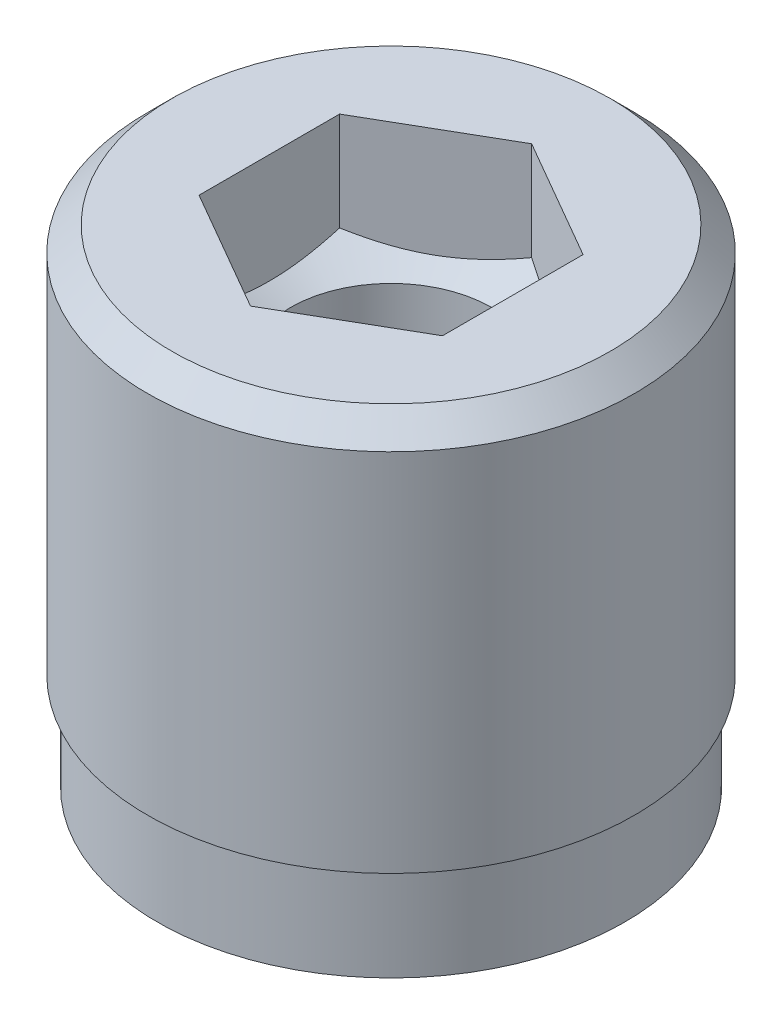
ISO-10303-21;
HEADER;
FILE_DESCRIPTION(('STEP AP214'),'2;1');
FILE_NAME('part.step','',(''),(''),'','','');
FILE_SCHEMA(('AUTOMOTIVE_DESIGN { 1 0 10303 214 1 1 1 1 }'));
ENDSEC;
DATA;
#1=APPLICATION_CONTEXT('core data for automotive mechanical design processes');
#2=APPLICATION_PROTOCOL_DEFINITION('international standard','automotive_design',2000,#1);
#3=PRODUCT_CONTEXT('',#1,'mechanical');
#4=PRODUCT('Part','Part','',(#3));
#5=PRODUCT_RELATED_PRODUCT_CATEGORY('part','',(#4));
#6=PRODUCT_DEFINITION_FORMATION('','',#4);
#7=PRODUCT_DEFINITION_CONTEXT('part definition',#1,'design');
#8=PRODUCT_DEFINITION('design','',#6,#7);
#9=PRODUCT_DEFINITION_SHAPE('','',#8);
#10=(LENGTH_UNIT() NAMED_UNIT(*) SI_UNIT(.MILLI.,.METRE.));
#11=(NAMED_UNIT(*) PLANE_ANGLE_UNIT() SI_UNIT($,.RADIAN.));
#12=(NAMED_UNIT(*) SI_UNIT($,.STERADIAN.) SOLID_ANGLE_UNIT());
#13=UNCERTAINTY_MEASURE_WITH_UNIT(LENGTH_MEASURE(1.E-05),#10,'distance_accuracy_value','');
#14=(GEOMETRIC_REPRESENTATION_CONTEXT(3) GLOBAL_UNCERTAINTY_ASSIGNED_CONTEXT((#13)) GLOBAL_UNIT_ASSIGNED_CONTEXT((#10,
#11,#12)) REPRESENTATION_CONTEXT('',''));
#15=CARTESIAN_POINT('',(0.,0.,0.));
#16=DIRECTION('',(0.,0.,1.));
#17=DIRECTION('',(1.,0.,0.));
#18=AXIS2_PLACEMENT_3D('',#15,#16,#17);
#19=CARTESIAN_POINT('',(0.,0.,0.));
#20=DIRECTION('',(0.,-1.,0.));
#21=DIRECTION('',(0.,0.,-1.));
#22=AXIS2_PLACEMENT_3D('',#19,#20,#21);
#23=CYLINDRICAL_SURFACE('',#22,2.065);
#24=CARTESIAN_POINT('',(0.,-3.75,0.));
#25=DIRECTION('',(0.,-1.,0.));
#26=DIRECTION('',(0.,0.,-1.));
#27=AXIS2_PLACEMENT_3D('',#24,#25,#26);
#28=CIRCLE('',#27,2.065);
#29=CARTESIAN_POINT('',(0.,-3.75,-2.065));
#30=VERTEX_POINT('',#29);
#31=EDGE_CURVE('E134',#30,#30,#28,.T.);
#32=ORIENTED_EDGE('',*,*,#31,.T.);
#33=EDGE_LOOP('',(#32));
#34=FACE_BOUND('',#33,.T.);
#35=CARTESIAN_POINT('',(0.,3.75,0.));
#36=DIRECTION('',(0.,-1.,0.));
#37=DIRECTION('',(0.,0.,-1.));
#38=AXIS2_PLACEMENT_3D('',#35,#36,#37);
#39=CIRCLE('',#38,2.065);
#40=CARTESIAN_POINT('',(0.,3.75,-2.065));
#41=VERTEX_POINT('',#40);
#42=EDGE_CURVE('E11',#41,#41,#39,.T.);
#43=ORIENTED_EDGE('',*,*,#42,.F.);
#44=EDGE_LOOP('',(#43));
#45=FACE_BOUND('',#44,.T.);
#46=ADVANCED_FACE('F33',(#34,#45),#23,.F.);
#47=CARTESIAN_POINT('',(0.,3.86547005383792,0.));
#48=DIRECTION('',(0.,1.,0.));
#49=DIRECTION('',(0.,0.,1.));
#50=AXIS2_PLACEMENT_3D('',#47,#48,#49);
#51=CONICAL_SURFACE('',#50,2.265,1.0471975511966);
#52=ORIENTED_EDGE('',*,*,#42,.T.);
#53=EDGE_LOOP('',(#52));
#54=FACE_BOUND('',#53,.T.);
#55=CARTESIAN_POINT('',(-0.000200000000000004,4.22450503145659,-2.88686681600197));
#56=CARTESIAN_POINT('',(0.109663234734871,4.18786898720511,-2.82343724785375));
#57=CARTESIAN_POINT('',(0.220474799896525,4.15454958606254,-2.75946016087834));
#58=CARTESIAN_POINT('',(0.444016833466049,4.09638965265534,-2.63039810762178));
#59=CARTESIAN_POINT('',(0.556751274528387,4.07156969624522,-2.5653108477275));
#60=CARTESIAN_POINT('',(0.780822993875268,4.03293301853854,-2.43594298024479));
#61=CARTESIAN_POINT('',(0.892125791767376,4.01885916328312,-2.37168227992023));
#62=CARTESIAN_POINT('',(1.11525522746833,4.00205651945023,-2.24285844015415));
#63=CARTESIAN_POINT('',(1.22708105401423,3.99931381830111,-2.17829576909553));
#64=CARTESIAN_POINT('',(1.43604197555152,4.00501312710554,-2.05765212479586));
#65=CARTESIAN_POINT('',(1.53320831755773,4.01205576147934,-2.0015531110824));
#66=CARTESIAN_POINT('',(1.726907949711,4.03437878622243,-1.88972057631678));
#67=CARTESIAN_POINT('',(1.82344056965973,4.04966680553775,-1.8339874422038));
#68=CARTESIAN_POINT('',(2.01753972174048,4.0878864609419,-1.7219242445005));
#69=CARTESIAN_POINT('',(2.11508168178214,4.110980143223,-1.66560836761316));
#70=CARTESIAN_POINT('',(2.30871060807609,4.1633940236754,-1.55381665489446));
#71=CARTESIAN_POINT('',(2.40480005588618,4.19270190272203,-1.49833938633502));
#72=CARTESIAN_POINT('',(2.5002,4.22450503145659,-1.44326020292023));
#73=B_SPLINE_CURVE_WITH_KNOTS('',3,(#55,#56,#57,#58,#59,#60,#61,#62,#63,#64,#65,#66,#67,#68,#69,
#70,#71,#72),.UNSPECIFIED.,.F.,.F.,(4,2,2,2,2,2,2,2,4),(0.,0.396285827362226,0.793524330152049,
1.18093086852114,1.56786160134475,1.90479741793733,2.24204551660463,2.58677531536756,
2.93082800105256),.UNSPECIFIED.);
#74=CARTESIAN_POINT('',(0.,4.22443836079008,-2.88675134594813));
#75=VERTEX_POINT('',#74);
#76=CARTESIAN_POINT('',(2.5,4.22443836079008,-1.44337567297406));
#77=VERTEX_POINT('',#76);
#78=EDGE_CURVE('E70',#75,#77,#73,.T.);
#79=ORIENTED_EDGE('',*,*,#78,.F.);
#80=CARTESIAN_POINT('',(-2.5002,4.22450503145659,-1.44326020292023));
#81=CARTESIAN_POINT('',(-2.39033676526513,4.18786898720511,-1.50668977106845));
#82=CARTESIAN_POINT('',(-2.27952520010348,4.15454958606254,-1.57066685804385));
#83=CARTESIAN_POINT('',(-2.05598316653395,4.09638965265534,-1.69972891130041));
#84=CARTESIAN_POINT('',(-1.94324872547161,4.07156969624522,-1.7648161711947));
#85=CARTESIAN_POINT('',(-1.71917700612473,4.03293301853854,-1.8941840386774));
#86=CARTESIAN_POINT('',(-1.60787420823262,4.01885916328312,-1.95844473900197));
#87=CARTESIAN_POINT('',(-1.38474477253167,4.00205651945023,-2.08726857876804));
#88=CARTESIAN_POINT('',(-1.27291894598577,3.99931381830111,-2.15183124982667));
#89=CARTESIAN_POINT('',(-1.06395802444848,4.00501312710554,-2.27247489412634));
#90=CARTESIAN_POINT('',(-0.96679168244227,4.01205576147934,-2.32857390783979));
#91=CARTESIAN_POINT('',(-0.773092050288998,4.03437878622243,-2.44040644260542));
#92=CARTESIAN_POINT('',(-0.676559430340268,4.04966680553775,-2.4961395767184));
#93=CARTESIAN_POINT('',(-0.482460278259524,4.0878864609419,-2.60820277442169));
#94=CARTESIAN_POINT('',(-0.38491831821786,4.110980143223,-2.66451865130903));
#95=CARTESIAN_POINT('',(-0.191289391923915,4.1633940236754,-2.77631036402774));
#96=CARTESIAN_POINT('',(-0.0951999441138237,4.19270190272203,-2.83178763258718));
#97=CARTESIAN_POINT('',(0.000200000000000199,4.22450503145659,-2.88686681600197));
#98=B_SPLINE_CURVE_WITH_KNOTS('',3,(#80,#81,#82,#83,#84,#85,#86,#87,#88,#89,#90,#91,#92,#93,#94,
#95,#96,#97),.UNSPECIFIED.,.F.,.F.,(4,2,2,2,2,2,2,2,4),(0.,0.396285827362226,0.79352433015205,
1.18093086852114,1.56786160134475,1.90479741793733,2.24204551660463,2.58677531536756,
2.93082800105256),.UNSPECIFIED.);
#99=CARTESIAN_POINT('',(-2.5,4.22443836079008,-1.44337567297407));
#100=VERTEX_POINT('',#99);
#101=EDGE_CURVE('E55',#100,#75,#98,.T.);
#102=ORIENTED_EDGE('',*,*,#101,.F.);
#103=CARTESIAN_POINT('',(-2.5,5.17474965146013,-3.7809682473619));
#104=CARTESIAN_POINT('',(-2.5,5.12250546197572,-3.67245506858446));
#105=CARTESIAN_POINT('',(-2.5,5.07079126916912,-3.56368198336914));
#106=CARTESIAN_POINT('',(-2.5,4.96872343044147,-3.34547718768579));
#107=CARTESIAN_POINT('',(-2.5,4.918370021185,-3.23604536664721));
#108=CARTESIAN_POINT('',(-2.5,4.8190503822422,-3.01577368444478));
#109=CARTESIAN_POINT('',(-2.5,4.77009409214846,-2.90492932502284));
#110=CARTESIAN_POINT('',(-2.5,4.67432110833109,-2.68232344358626));
#111=CARTESIAN_POINT('',(-2.5,4.62750430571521,-2.5705619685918));
#112=CARTESIAN_POINT('',(-2.5,4.53535356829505,-2.34291627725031));
#113=CARTESIAN_POINT('',(-2.5,4.49009339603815,-2.22700202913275));
#114=CARTESIAN_POINT('',(-2.5,4.40323711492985,-1.99378304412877));
#115=CARTESIAN_POINT('',(-2.5,4.36164142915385,-1.87647814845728));
#116=CARTESIAN_POINT('',(-2.5,4.28327574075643,-1.6405430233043));
#117=CARTESIAN_POINT('',(-2.5,4.24649511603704,-1.52191635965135));
#118=CARTESIAN_POINT('',(-2.5,4.17900136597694,-1.28296660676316));
#119=CARTESIAN_POINT('',(-2.5,4.14828622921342,-1.16264409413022));
#120=CARTESIAN_POINT('',(-2.5,4.09459350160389,-0.920790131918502));
#121=CARTESIAN_POINT('',(-2.5,4.07158349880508,-0.799266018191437));
#122=CARTESIAN_POINT('',(-2.5,4.0346975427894,-0.554814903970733));
#123=CARTESIAN_POINT('',(-2.5,4.02082079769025,-0.431888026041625));
#124=CARTESIAN_POINT('',(-2.5,4.00348927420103,-0.186798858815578));
#125=CARTESIAN_POINT('',(-2.5,3.99990876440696,-0.064645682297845));
#126=CARTESIAN_POINT('',(-2.5,4.00314793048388,0.179533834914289));
#127=CARTESIAN_POINT('',(-2.5,4.00996839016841,0.301560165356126));
#128=CARTESIAN_POINT('',(-2.5,4.03019153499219,0.51157116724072));
#129=CARTESIAN_POINT('',(-2.5,4.04129956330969,0.599788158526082));
#130=CARTESIAN_POINT('',(-2.5,4.0682067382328,0.775508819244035));
#131=CARTESIAN_POINT('',(-2.5,4.08400659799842,0.863012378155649));
#132=CARTESIAN_POINT('',(-2.5,4.13760551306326,1.12436306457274));
#133=CARTESIAN_POINT('',(-2.5,4.18159320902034,1.29695150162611));
#134=CARTESIAN_POINT('',(-2.5,4.25707008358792,1.55516150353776));
#135=CARTESIAN_POINT('',(-2.5,4.28418817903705,1.64213551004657));
#136=CARTESIAN_POINT('',(-2.5,4.34102860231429,1.81523661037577));
#137=CARTESIAN_POINT('',(-2.5,4.37075095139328,1.90136369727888));
#138=CARTESIAN_POINT('',(-2.5,4.43234048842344,2.07280689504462));
#139=CARTESIAN_POINT('',(-2.5,4.46420692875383,2.15812327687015));
#140=CARTESIAN_POINT('',(-2.5,4.52973127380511,2.32805984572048));
#141=CARTESIAN_POINT('',(-2.5,4.56338911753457,2.41268005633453));
#142=CARTESIAN_POINT('',(-2.5,4.67264979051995,2.68049828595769));
#143=CARTESIAN_POINT('',(-2.5,4.75102087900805,2.86256625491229));
#144=CARTESIAN_POINT('',(-2.5,4.91253856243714,3.22458004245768));
#145=CARTESIAN_POINT('',(-2.5,4.99568595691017,3.40452549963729));
#146=CARTESIAN_POINT('',(-2.5,5.16538487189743,3.76290370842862));
#147=CARTESIAN_POINT('',(-2.5,5.25193799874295,3.94133569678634));
#148=CARTESIAN_POINT('',(-2.5,5.42748179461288,4.29699920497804));
#149=CARTESIAN_POINT('',(-2.5,5.51647254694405,4.47423068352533));
#150=CARTESIAN_POINT('',(-2.5,5.69643113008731,4.8281027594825));
#151=CARTESIAN_POINT('',(-2.5,5.78740234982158,5.00474162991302));
#152=CARTESIAN_POINT('',(-2.5,5.97072878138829,5.35730043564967));
#153=CARTESIAN_POINT('',(-2.5,6.06308400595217,5.5332203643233));
#154=CARTESIAN_POINT('',(-2.5,6.34168357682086,6.06003161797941));
#155=CARTESIAN_POINT('',(-2.5,6.52951705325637,6.41008197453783));
#156=CARTESIAN_POINT('',(-2.5,6.88280460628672,7.06247892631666));
#157=CARTESIAN_POINT('',(-2.5,7.047928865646,7.36500491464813));
#158=CARTESIAN_POINT('',(-2.5,7.37962766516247,7.96929540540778));
#159=CARTESIAN_POINT('',(-2.5,7.54620233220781,8.27105983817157));
#160=CARTESIAN_POINT('',(-2.5,7.87979869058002,8.87293648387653));
#161=CARTESIAN_POINT('',(-2.5,8.0468166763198,9.17305075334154));
#162=CARTESIAN_POINT('',(-2.5,8.38163185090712,9.77280547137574));
#163=CARTESIAN_POINT('',(-2.5,8.54942896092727,10.0724459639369));
#164=CARTESIAN_POINT('',(-2.5,8.71750442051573,10.3719295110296));
#165=B_SPLINE_CURVE_WITH_KNOTS('',3,(#103,#104,#105,#106,#107,#108,#109,#110,#111,#112,#113,
#114,#115,#116,#117,#118,#119,#120,#121,#122,#123,#124,#125,#126,#127,#128,#129,#130,#131,#132,
#133,#134,#135,#136,#137,#138,#139,#140,#141,#142,#143,#144,#145,#146,#147,#148,#149,#150,#151,
#152,#153,#154,#155,#156,#157,#158,#159,#160,#161,#162,#163,#164),.UNSPECIFIED.,.F.,.F.,(4,2,2,
2,2,2,2,2,2,2,2,2,2,2,2,2,2,2,2,2,2,2,2,2,2,2,2,2,2,2,4),(0.,0.361309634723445,
0.722681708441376,1.0861863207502,1.44967241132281,1.82293594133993,2.19624250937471,
2.56871115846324,2.9410560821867,3.3118144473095,3.68254066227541,4.04872016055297,
4.41492725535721,4.68153717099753,4.94818763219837,5.48178506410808,5.75507544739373,
6.02836806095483,6.30156586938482,6.57475438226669,7.16929370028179,7.76393283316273,
8.35885587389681,8.95379927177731,9.54985629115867,10.1459187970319,11.3376810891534,
12.3716464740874,13.4057032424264,14.4360768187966,15.4663483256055),.UNSPECIFIED.);
#166=CARTESIAN_POINT('',(-2.5,4.22443836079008,1.44337567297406));
#167=VERTEX_POINT('',#166);
#168=EDGE_CURVE('E78',#167,#100,#165,.F.);
#169=ORIENTED_EDGE('',*,*,#168,.F.);
#170=CARTESIAN_POINT('',(0.000200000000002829,4.22450503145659,2.88686681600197));
#171=CARTESIAN_POINT('',(-0.109663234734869,4.18786898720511,2.82343724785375));
#172=CARTESIAN_POINT('',(-0.220474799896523,4.15454958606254,2.75946016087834));
#173=CARTESIAN_POINT('',(-0.444016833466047,4.09638965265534,2.63039810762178));
#174=CARTESIAN_POINT('',(-0.556751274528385,4.07156969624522,2.5653108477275));
#175=CARTESIAN_POINT('',(-0.780822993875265,4.03293301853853,2.43594298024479));
#176=CARTESIAN_POINT('',(-0.892125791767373,4.01885916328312,2.37168227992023));
#177=CARTESIAN_POINT('',(-1.11525522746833,4.00205651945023,2.24285844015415));
#178=CARTESIAN_POINT('',(-1.22708105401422,3.99931381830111,2.17829576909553));
#179=CARTESIAN_POINT('',(-1.43604197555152,4.00501312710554,2.05765212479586));
#180=CARTESIAN_POINT('',(-1.53320831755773,4.01205576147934,2.0015531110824));
#181=CARTESIAN_POINT('',(-1.726907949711,4.03437878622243,1.88972057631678));
#182=CARTESIAN_POINT('',(-1.82344056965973,4.04966680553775,1.8339874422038));
#183=CARTESIAN_POINT('',(-2.01753972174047,4.0878864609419,1.7219242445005));
#184=CARTESIAN_POINT('',(-2.11508168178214,4.110980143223,1.66560836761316));
#185=CARTESIAN_POINT('',(-2.30871060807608,4.16339402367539,1.55381665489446));
#186=CARTESIAN_POINT('',(-2.40480005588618,4.19270190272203,1.49833938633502));
#187=CARTESIAN_POINT('',(-2.5002,4.22450503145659,1.44326020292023));
#188=B_SPLINE_CURVE_WITH_KNOTS('',3,(#170,#171,#172,#173,#174,#175,#176,#177,#178,#179,#180,
#181,#182,#183,#184,#185,#186,#187),.UNSPECIFIED.,.F.,.F.,(4,2,2,2,2,2,2,2,4),(0.,
0.396285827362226,0.79352433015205,1.18093086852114,1.56786160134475,1.90479741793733,
2.24204551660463,2.58677531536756,2.93082800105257),.UNSPECIFIED.);
#189=CARTESIAN_POINT('',(0.,4.22443836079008,2.88675134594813));
#190=VERTEX_POINT('',#189);
#191=EDGE_CURVE('E156',#190,#167,#188,.T.);
#192=ORIENTED_EDGE('',*,*,#191,.F.);
#193=CARTESIAN_POINT('',(2.5002,4.22450503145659,1.44326020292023));
#194=CARTESIAN_POINT('',(2.39033676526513,4.18786898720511,1.50668977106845));
#195=CARTESIAN_POINT('',(2.27952520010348,4.15454958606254,1.57066685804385));
#196=CARTESIAN_POINT('',(2.05598316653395,4.09638965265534,1.69972891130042));
#197=CARTESIAN_POINT('',(1.94324872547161,4.07156969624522,1.7648161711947));
#198=CARTESIAN_POINT('',(1.71917700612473,4.03293301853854,1.8941840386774));
#199=CARTESIAN_POINT('',(1.60787420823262,4.01885916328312,1.95844473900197));
#200=CARTESIAN_POINT('',(1.38474477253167,4.00205651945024,2.08726857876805));
#201=CARTESIAN_POINT('',(1.27291894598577,3.99931381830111,2.15183124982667));
#202=CARTESIAN_POINT('',(1.06395802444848,4.00501312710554,2.27247489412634));
#203=CARTESIAN_POINT('',(0.96679168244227,4.01205576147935,2.3285739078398));
#204=CARTESIAN_POINT('',(0.773092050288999,4.03437878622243,2.44040644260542));
#205=CARTESIAN_POINT('',(0.67655943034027,4.04966680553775,2.4961395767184));
#206=CARTESIAN_POINT('',(0.482460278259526,4.0878864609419,2.60820277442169));
#207=CARTESIAN_POINT('',(0.384918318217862,4.110980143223,2.66451865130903));
#208=CARTESIAN_POINT('',(0.191289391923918,4.16339402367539,2.77631036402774));
#209=CARTESIAN_POINT('',(0.0951999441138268,4.19270190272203,2.83178763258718));
#210=CARTESIAN_POINT('',(-0.000199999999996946,4.22450503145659,2.88686681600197));
#211=B_SPLINE_CURVE_WITH_KNOTS('',3,(#193,#194,#195,#196,#197,#198,#199,#200,#201,#202,#203,
#204,#205,#206,#207,#208,#209,#210),.UNSPECIFIED.,.F.,.F.,(4,2,2,2,2,2,2,2,4),(0.,
0.396285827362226,0.79352433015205,1.18093086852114,1.56786160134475,1.90479741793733,
2.24204551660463,2.58677531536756,2.93082800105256),.UNSPECIFIED.);
#212=CARTESIAN_POINT('',(2.5,4.22443836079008,1.44337567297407));
#213=VERTEX_POINT('',#212);
#214=EDGE_CURVE('E162',#213,#190,#211,.T.);
#215=ORIENTED_EDGE('',*,*,#214,.F.);
#216=CARTESIAN_POINT('',(2.5,5.17474965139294,-3.78096824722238));
#217=CARTESIAN_POINT('',(2.5,5.12250546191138,-3.67245506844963));
#218=CARTESIAN_POINT('',(2.5,5.07079126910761,-3.56368198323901));
#219=CARTESIAN_POINT('',(2.5,4.96872343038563,-3.34547718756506));
#220=CARTESIAN_POINT('',(2.5,4.91837002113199,-3.23604536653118));
#221=CARTESIAN_POINT('',(2.5,4.81905038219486,-3.01577368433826));
#222=CARTESIAN_POINT('',(2.5,4.77009409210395,-2.9049293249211));
#223=CARTESIAN_POINT('',(2.5,4.67432110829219,-2.68232344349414));
#224=CARTESIAN_POINT('',(2.5,4.6275043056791,-2.57056196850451));
#225=CARTESIAN_POINT('',(2.5,4.53535356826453,-2.34291627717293));
#226=CARTESIAN_POINT('',(2.5,4.49009339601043,-2.22700202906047));
#227=CARTESIAN_POINT('',(2.5,4.40323711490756,-1.99378304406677));
#228=CARTESIAN_POINT('',(2.5,4.36164142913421,-1.87647814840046));
#229=CARTESIAN_POINT('',(2.5,4.2832757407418,-1.64054302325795));
#230=CARTESIAN_POINT('',(2.5,4.24649511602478,-1.52191635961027));
#231=CARTESIAN_POINT('',(2.5,4.17900136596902,-1.2829666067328));
#232=CARTESIAN_POINT('',(2.5,4.14828622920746,-1.16264409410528));
#233=CARTESIAN_POINT('',(2.5,4.09459350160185,-0.920790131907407));
#234=CARTESIAN_POINT('',(2.5,4.07158349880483,-0.799266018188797));
#235=CARTESIAN_POINT('',(2.5,4.03469754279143,-0.554814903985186));
#236=CARTESIAN_POINT('',(2.5,4.02082079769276,-0.431888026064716));
#237=CARTESIAN_POINT('',(2.5,4.003489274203,-0.186798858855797));
#238=CARTESIAN_POINT('',(2.5,3.99990876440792,-0.0646456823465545));
#239=CARTESIAN_POINT('',(2.5,4.0031479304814,0.179533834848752));
#240=CARTESIAN_POINT('',(2.5,4.0099683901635,0.301560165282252));
#241=CARTESIAN_POINT('',(2.5,4.03019153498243,0.51157116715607));
#242=CARTESIAN_POINT('',(2.5,4.04129956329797,0.599788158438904));
#243=CARTESIAN_POINT('',(2.5,4.06820673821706,0.775508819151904));
#244=CARTESIAN_POINT('',(2.5,4.08400659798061,0.863012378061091));
#245=CARTESIAN_POINT('',(2.5,4.13760551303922,1.12436306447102));
#246=CARTESIAN_POINT('',(2.5,4.18159320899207,1.29695150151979));
#247=CARTESIAN_POINT('',(2.5,4.25707008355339,1.55516150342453));
#248=CARTESIAN_POINT('',(2.5,4.28418817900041,1.64213550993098));
#249=CARTESIAN_POINT('',(2.5,4.34102860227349,1.81523661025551));
#250=CARTESIAN_POINT('',(2.5,4.37075095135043,1.90136369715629));
#251=CARTESIAN_POINT('',(2.5,4.43234048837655,2.07280689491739));
#252=CARTESIAN_POINT('',(2.5,4.46420692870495,2.1581232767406));
#253=CARTESIAN_POINT('',(2.5,4.52973127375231,2.3280598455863));
#254=CARTESIAN_POINT('',(2.5,4.56338911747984,2.41268005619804));
#255=CARTESIAN_POINT('',(2.5,4.67264979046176,2.68049828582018));
#256=CARTESIAN_POINT('',(2.5,4.75102087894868,2.86256625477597));
#257=CARTESIAN_POINT('',(2.5,4.91253856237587,3.22458004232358));
#258=CARTESIAN_POINT('',(2.5,4.99568595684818,3.40452549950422));
#259=CARTESIAN_POINT('',(2.5,5.16538487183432,3.76290370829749));
#260=CARTESIAN_POINT('',(2.5,5.25193799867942,3.94133569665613));
#261=CARTESIAN_POINT('',(2.5,5.42748179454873,4.29699920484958));
#262=CARTESIAN_POINT('',(2.5,5.51647254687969,4.4742306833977));
#263=CARTESIAN_POINT('',(2.5,5.6964311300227,4.82810275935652));
#264=CARTESIAN_POINT('',(2.5,5.78740234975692,5.00474162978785));
#265=CARTESIAN_POINT('',(2.5,5.97072878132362,5.3573004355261));
#266=CARTESIAN_POINT('',(2.5,6.06308400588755,5.5332203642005));
#267=CARTESIAN_POINT('',(2.5,6.34168357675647,6.06003161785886));
#268=CARTESIAN_POINT('',(2.5,6.52951705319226,6.41008197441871));
#269=CARTESIAN_POINT('',(2.5,6.88280460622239,7.0624789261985));
#270=CARTESIAN_POINT('',(2.5,7.04792886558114,7.36500491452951));
#271=CARTESIAN_POINT('',(2.5,7.3796276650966,7.96929540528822));
#272=CARTESIAN_POINT('',(2.5,7.54620233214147,8.27105983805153));
#273=CARTESIAN_POINT('',(2.5,7.87979869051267,8.87293648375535));
#274=CARTESIAN_POINT('',(2.5,8.04681667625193,9.17305075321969));
#275=CARTESIAN_POINT('',(2.5,8.38163185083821,9.77280547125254));
#276=CARTESIAN_POINT('',(2.5,8.54942896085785,10.0724459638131));
#277=CARTESIAN_POINT('',(2.5,8.71750442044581,10.3719295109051));
#278=B_SPLINE_CURVE_WITH_KNOTS('',3,(#216,#217,#218,#219,#220,#221,#222,#223,#224,#225,#226,
#227,#228,#229,#230,#231,#232,#233,#234,#235,#236,#237,#238,#239,#240,#241,#242,#243,#244,#245,
#246,#247,#248,#249,#250,#251,#252,#253,#254,#255,#256,#257,#258,#259,#260,#261,#262,#263,#264,
#265,#266,#267,#268,#269,#270,#271,#272,#273,#274,#275,#276,#277),.UNSPECIFIED.,.F.,.F.,(4,2,2,
2,2,2,2,2,2,2,2,2,2,2,2,2,2,2,2,2,2,2,2,2,2,2,2,2,2,2,4),(0.,0.361309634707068,
0.722681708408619,1.08618632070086,1.44967241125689,1.82293594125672,2.1962425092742,
2.56871115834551,2.94105608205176,3.31181444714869,3.68254066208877,4.04872016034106,
4.41492725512,4.68153717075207,4.94818763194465,5.48178506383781,5.75507544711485,
6.02836806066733,6.30156586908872,6.574754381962,7.16929369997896,7.76393283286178,
8.3588558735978,8.95379927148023,9.54985629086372,10.1459187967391,11.3376810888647,
12.3716464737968,13.4057032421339,14.4360768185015,15.4663483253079),.UNSPECIFIED.);
#279=EDGE_CURVE('E168',#77,#213,#278,.T.);
#280=ORIENTED_EDGE('',*,*,#279,.F.);
#281=EDGE_LOOP('',(#79,#102,#169,#192,#215,#280));
#282=FACE_BOUND('',#281,.T.);
#283=ADVANCED_FACE('F139',(#54,#282),#51,.F.);
#284=CARTESIAN_POINT('',(2.265,6.25,0.));
#285=DIRECTION('',(0.,1.,0.));
#286=DIRECTION('',(0.,0.,1.));
#287=AXIS2_PLACEMENT_3D('',#284,#285,#286);
#288=PLANE('',#287);
#289=DIRECTION('',(-0.866025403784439,0.,-0.5));
#290=VECTOR('',#289,1.);
#291=CARTESIAN_POINT('',(2.5,6.25,-1.44337567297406));
#292=LINE('',#291,#290);
#293=CARTESIAN_POINT('',(2.5,6.25,-1.44337567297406));
#294=VERTEX_POINT('',#293);
#295=CARTESIAN_POINT('',(0.,6.25,-2.88675134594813));
#296=VERTEX_POINT('',#295);
#297=EDGE_CURVE('E47',#294,#296,#292,.T.);
#298=ORIENTED_EDGE('',*,*,#297,.F.);
#299=DIRECTION('',(0.,0.,-1.));
#300=VECTOR('',#299,1.);
#301=CARTESIAN_POINT('',(2.5,6.25,1.44337567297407));
#302=LINE('',#301,#300);
#303=CARTESIAN_POINT('',(2.5,6.25,1.44337567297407));
#304=VERTEX_POINT('',#303);
#305=EDGE_CURVE('E120',#304,#294,#302,.T.);
#306=ORIENTED_EDGE('',*,*,#305,.F.);
#307=DIRECTION('',(0.866025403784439,0.,-0.5));
#308=VECTOR('',#307,1.);
#309=CARTESIAN_POINT('',(0.,6.25,2.88675134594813));
#310=LINE('',#309,#308);
#311=CARTESIAN_POINT('',(0.,6.25,2.88675134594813));
#312=VERTEX_POINT('',#311);
#313=EDGE_CURVE('E114',#312,#304,#310,.T.);
#314=ORIENTED_EDGE('',*,*,#313,.F.);
#315=DIRECTION('',(0.866025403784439,0.,0.5));
#316=VECTOR('',#315,1.);
#317=CARTESIAN_POINT('',(-2.5,6.25,1.44337567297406));
#318=LINE('',#317,#316);
#319=CARTESIAN_POINT('',(-2.5,6.25,1.44337567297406));
#320=VERTEX_POINT('',#319);
#321=EDGE_CURVE('E112',#320,#312,#318,.T.);
#322=ORIENTED_EDGE('',*,*,#321,.F.);
#323=DIRECTION('',(0.,0.,1.));
#324=VECTOR('',#323,1.);
#325=CARTESIAN_POINT('',(-2.5,6.25,-1.44337567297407));
#326=LINE('',#325,#324);
#327=CARTESIAN_POINT('',(-2.5,6.25,-1.44337567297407));
#328=VERTEX_POINT('',#327);
#329=EDGE_CURVE('E98',#328,#320,#326,.T.);
#330=ORIENTED_EDGE('',*,*,#329,.F.);
#331=DIRECTION('',(-0.866025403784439,0.,0.5));
#332=VECTOR('',#331,1.);
#333=CARTESIAN_POINT('',(0.,6.25,-2.88675134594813));
#334=LINE('',#333,#332);
#335=EDGE_CURVE('E104',#296,#328,#334,.T.);
#336=ORIENTED_EDGE('',*,*,#335,.F.);
#337=EDGE_LOOP('',(#298,#306,#314,#322,#330,#336));
#338=FACE_BOUND('',#337,.T.);
#339=CARTESIAN_POINT('',(0.,6.25,0.));
#340=DIRECTION('',(0.,-1.,0.));
#341=DIRECTION('',(0.,0.,-1.));
#342=AXIS2_PLACEMENT_3D('',#339,#340,#341);
#343=CIRCLE('',#342,4.5);
#344=CARTESIAN_POINT('',(0.,6.25,-4.5));
#345=VERTEX_POINT('',#344);
#346=EDGE_CURVE('E40',#345,#345,#343,.T.);
#347=ORIENTED_EDGE('',*,*,#346,.F.);
#348=EDGE_LOOP('',(#347));
#349=FACE_BOUND('',#348,.T.);
#350=ADVANCED_FACE('F108',(#338,#349),#288,.T.);
#351=CARTESIAN_POINT('',(0.,5.75,0.));
#352=DIRECTION('',(0.,-1.,0.));
#353=DIRECTION('',(0.,0.,-1.));
#354=AXIS2_PLACEMENT_3D('',#351,#352,#353);
#355=CONICAL_SURFACE('',#354,5.,0.785398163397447);
#356=ORIENTED_EDGE('',*,*,#346,.T.);
#357=EDGE_LOOP('',(#356));
#358=FACE_BOUND('',#357,.T.);
#359=CARTESIAN_POINT('',(0.,5.75,0.));
#360=DIRECTION('',(0.,-1.,0.));
#361=DIRECTION('',(0.,0.,-1.));
#362=AXIS2_PLACEMENT_3D('',#359,#360,#361);
#363=CIRCLE('',#362,5.);
#364=CARTESIAN_POINT('',(0.,5.75,-5.));
#365=VERTEX_POINT('',#364);
#366=EDGE_CURVE('E235',#365,#365,#363,.T.);
#367=ORIENTED_EDGE('',*,*,#366,.F.);
#368=EDGE_LOOP('',(#367));
#369=FACE_BOUND('',#368,.T.);
#370=ADVANCED_FACE('F223',(#358,#369),#355,.T.);
#371=CARTESIAN_POINT('',(0.,0.,0.));
#372=DIRECTION('',(0.,-1.,0.));
#373=DIRECTION('',(0.,0.,-1.));
#374=AXIS2_PLACEMENT_3D('',#371,#372,#373);
#375=CYLINDRICAL_SURFACE('',#374,5.);
#376=ORIENTED_EDGE('',*,*,#366,.T.);
#377=EDGE_LOOP('',(#376));
#378=FACE_BOUND('',#377,.T.);
#379=CARTESIAN_POINT('',(0.,-1.75,0.));
#380=DIRECTION('',(0.,-1.,0.));
#381=DIRECTION('',(0.,0.,-1.));
#382=AXIS2_PLACEMENT_3D('',#379,#380,#381);
#383=CIRCLE('',#382,5.);
#384=CARTESIAN_POINT('',(0.,-1.75,-5.));
#385=VERTEX_POINT('',#384);
#386=EDGE_CURVE('E236',#385,#385,#383,.T.);
#387=ORIENTED_EDGE('',*,*,#386,.F.);
#388=EDGE_LOOP('',(#387));
#389=FACE_BOUND('',#388,.T.);
#390=ADVANCED_FACE('F220',(#378,#389),#375,.T.);
#391=CARTESIAN_POINT('',(5.,-1.75,0.));
#392=DIRECTION('',(0.,-1.,0.));
#393=DIRECTION('',(0.,0.,-1.));
#394=AXIS2_PLACEMENT_3D('',#391,#392,#393);
#395=PLANE('',#394);
#396=ORIENTED_EDGE('',*,*,#386,.T.);
#397=EDGE_LOOP('',(#396));
#398=FACE_BOUND('',#397,.T.);
#399=CARTESIAN_POINT('',(0.,-1.75,0.));
#400=DIRECTION('',(0.,-1.,0.));
#401=DIRECTION('',(0.,0.,-1.));
#402=AXIS2_PLACEMENT_3D('',#399,#400,#401);
#403=CIRCLE('',#402,4.8);
#404=CARTESIAN_POINT('',(0.,-1.75,-4.8));
#405=VERTEX_POINT('',#404);
#406=EDGE_CURVE('E239',#405,#405,#403,.T.);
#407=ORIENTED_EDGE('',*,*,#406,.F.);
#408=EDGE_LOOP('',(#407));
#409=FACE_BOUND('',#408,.T.);
#410=ADVANCED_FACE('F216',(#398,#409),#395,.T.);
#411=CARTESIAN_POINT('',(0.,0.,0.));
#412=DIRECTION('',(0.,-1.,0.));
#413=DIRECTION('',(0.,0.,-1.));
#414=AXIS2_PLACEMENT_3D('',#411,#412,#413);
#415=CYLINDRICAL_SURFACE('',#414,4.8);
#416=ORIENTED_EDGE('',*,*,#406,.T.);
#417=EDGE_LOOP('',(#416));
#418=FACE_BOUND('',#417,.T.);
#419=CARTESIAN_POINT('',(0.,-3.75,0.));
#420=DIRECTION('',(0.,-1.,0.));
#421=DIRECTION('',(0.,0.,-1.));
#422=AXIS2_PLACEMENT_3D('',#419,#420,#421);
#423=CIRCLE('',#422,4.8);
#424=CARTESIAN_POINT('',(0.,-3.75,-4.8));
#425=VERTEX_POINT('',#424);
#426=EDGE_CURVE('E243',#425,#425,#423,.T.);
#427=ORIENTED_EDGE('',*,*,#426,.F.);
#428=EDGE_LOOP('',(#427));
#429=FACE_BOUND('',#428,.T.);
#430=ADVANCED_FACE('F209',(#418,#429),#415,.T.);
#431=CARTESIAN_POINT('',(2.065,-3.75,0.));
#432=DIRECTION('',(0.,-1.,0.));
#433=DIRECTION('',(0.,0.,-1.));
#434=AXIS2_PLACEMENT_3D('',#431,#432,#433);
#435=PLANE('',#434);
#436=ORIENTED_EDGE('',*,*,#426,.T.);
#437=EDGE_LOOP('',(#436));
#438=FACE_BOUND('',#437,.T.);
#439=ORIENTED_EDGE('',*,*,#31,.F.);
#440=EDGE_LOOP('',(#439));
#441=FACE_BOUND('',#440,.T.);
#442=ADVANCED_FACE('F205',(#438,#441),#435,.T.);
#443=CARTESIAN_POINT('',(2.5,-3.751,-1.44337567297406));
#444=DIRECTION('',(0.5,0.,-0.866025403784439));
#445=DIRECTION('',(-0.866025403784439,0.,-0.5));
#446=AXIS2_PLACEMENT_3D('',#443,#444,#445);
#447=PLANE('',#446);
#448=ORIENTED_EDGE('',*,*,#78,.T.);
#449=DIRECTION('',(0.,1.,0.));
#450=VECTOR('',#449,1.);
#451=CARTESIAN_POINT('',(2.5,-3.751,-1.44337567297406));
#452=LINE('',#451,#450);
#453=EDGE_CURVE('E81',#77,#294,#452,.T.);
#454=ORIENTED_EDGE('',*,*,#453,.T.);
#455=ORIENTED_EDGE('',*,*,#297,.T.);
#456=DIRECTION('',(0.,1.,0.));
#457=VECTOR('',#456,1.);
#458=CARTESIAN_POINT('',(0.,-3.751,-2.88675134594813));
#459=LINE('',#458,#457);
#460=EDGE_CURVE('E101',#75,#296,#459,.T.);
#461=ORIENTED_EDGE('',*,*,#460,.F.);
#462=EDGE_LOOP('',(#448,#454,#455,#461));
#463=FACE_BOUND('',#462,.T.);
#464=ADVANCED_FACE('F180',(#463),#447,.F.);
#465=CARTESIAN_POINT('',(2.5,-3.751,1.44337567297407));
#466=DIRECTION('',(1.,0.,0.));
#467=DIRECTION('',(0.,0.,-1.));
#468=AXIS2_PLACEMENT_3D('',#465,#466,#467);
#469=PLANE('',#468);
#470=ORIENTED_EDGE('',*,*,#279,.T.);
#471=DIRECTION('',(0.,1.,0.));
#472=VECTOR('',#471,1.);
#473=CARTESIAN_POINT('',(2.5,-3.751,1.44337567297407));
#474=LINE('',#473,#472);
#475=EDGE_CURVE('E123',#213,#304,#474,.T.);
#476=ORIENTED_EDGE('',*,*,#475,.T.);
#477=ORIENTED_EDGE('',*,*,#305,.T.);
#478=ORIENTED_EDGE('',*,*,#453,.F.);
#479=EDGE_LOOP('',(#470,#476,#477,#478));
#480=FACE_BOUND('',#479,.T.);
#481=ADVANCED_FACE('F176',(#480),#469,.F.);
#482=CARTESIAN_POINT('',(0.,-3.751,2.88675134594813));
#483=DIRECTION('',(0.5,0.,0.866025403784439));
#484=DIRECTION('',(0.866025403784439,0.,-0.5));
#485=AXIS2_PLACEMENT_3D('',#482,#483,#484);
#486=PLANE('',#485);
#487=ORIENTED_EDGE('',*,*,#214,.T.);
#488=DIRECTION('',(0.,1.,0.));
#489=VECTOR('',#488,1.);
#490=CARTESIAN_POINT('',(0.,-3.751,2.88675134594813));
#491=LINE('',#490,#489);
#492=EDGE_CURVE('E125',#190,#312,#491,.T.);
#493=ORIENTED_EDGE('',*,*,#492,.T.);
#494=ORIENTED_EDGE('',*,*,#313,.T.);
#495=ORIENTED_EDGE('',*,*,#475,.F.);
#496=EDGE_LOOP('',(#487,#493,#494,#495));
#497=FACE_BOUND('',#496,.T.);
#498=ADVANCED_FACE('F179',(#497),#486,.F.);
#499=CARTESIAN_POINT('',(-2.5,-3.751,1.44337567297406));
#500=DIRECTION('',(-0.5,0.,0.866025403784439));
#501=DIRECTION('',(0.866025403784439,0.,0.5));
#502=AXIS2_PLACEMENT_3D('',#499,#500,#501);
#503=PLANE('',#502);
#504=ORIENTED_EDGE('',*,*,#191,.T.);
#505=DIRECTION('',(0.,1.,0.));
#506=VECTOR('',#505,1.);
#507=CARTESIAN_POINT('',(-2.5,-3.751,1.44337567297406));
#508=LINE('',#507,#506);
#509=EDGE_CURVE('E100',#167,#320,#508,.T.);
#510=ORIENTED_EDGE('',*,*,#509,.T.);
#511=ORIENTED_EDGE('',*,*,#321,.T.);
#512=ORIENTED_EDGE('',*,*,#492,.F.);
#513=EDGE_LOOP('',(#504,#510,#511,#512));
#514=FACE_BOUND('',#513,.T.);
#515=ADVANCED_FACE('F184',(#514),#503,.F.);
#516=CARTESIAN_POINT('',(-2.5,-3.751,-1.44337567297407));
#517=DIRECTION('',(-1.,0.,0.));
#518=DIRECTION('',(0.,0.,1.));
#519=AXIS2_PLACEMENT_3D('',#516,#517,#518);
#520=PLANE('',#519);
#521=ORIENTED_EDGE('',*,*,#168,.T.);
#522=DIRECTION('',(0.,1.,0.));
#523=VECTOR('',#522,1.);
#524=CARTESIAN_POINT('',(-2.5,-3.751,-1.44337567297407));
#525=LINE('',#524,#523);
#526=EDGE_CURVE('E94',#100,#328,#525,.T.);
#527=ORIENTED_EDGE('',*,*,#526,.T.);
#528=ORIENTED_EDGE('',*,*,#329,.T.);
#529=ORIENTED_EDGE('',*,*,#509,.F.);
#530=EDGE_LOOP('',(#521,#527,#528,#529));
#531=FACE_BOUND('',#530,.T.);
#532=ADVANCED_FACE('F96',(#531),#520,.F.);
#533=CARTESIAN_POINT('',(0.,-3.751,-2.88675134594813));
#534=DIRECTION('',(-0.5,0.,-0.866025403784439));
#535=DIRECTION('',(-0.866025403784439,0.,0.5));
#536=AXIS2_PLACEMENT_3D('',#533,#534,#535);
#537=PLANE('',#536);
#538=ORIENTED_EDGE('',*,*,#101,.T.);
#539=ORIENTED_EDGE('',*,*,#460,.T.);
#540=ORIENTED_EDGE('',*,*,#335,.T.);
#541=ORIENTED_EDGE('',*,*,#526,.F.);
#542=EDGE_LOOP('',(#538,#539,#540,#541));
#543=FACE_BOUND('',#542,.T.);
#544=ADVANCED_FACE('F105',(#543),#537,.F.);
#545=CLOSED_SHELL('',(#46,#283,#350,#370,#390,#410,#430,#442,#464,#481,#498,#515,#532,#544));
#546=MANIFOLD_SOLID_BREP('B2',#545);
#547=ADVANCED_BREP_SHAPE_REPRESENTATION('',(#18,#546),#14);
#548=SHAPE_DEFINITION_REPRESENTATION(#9,#547);
ENDSEC;
END-ISO-10303-21;
